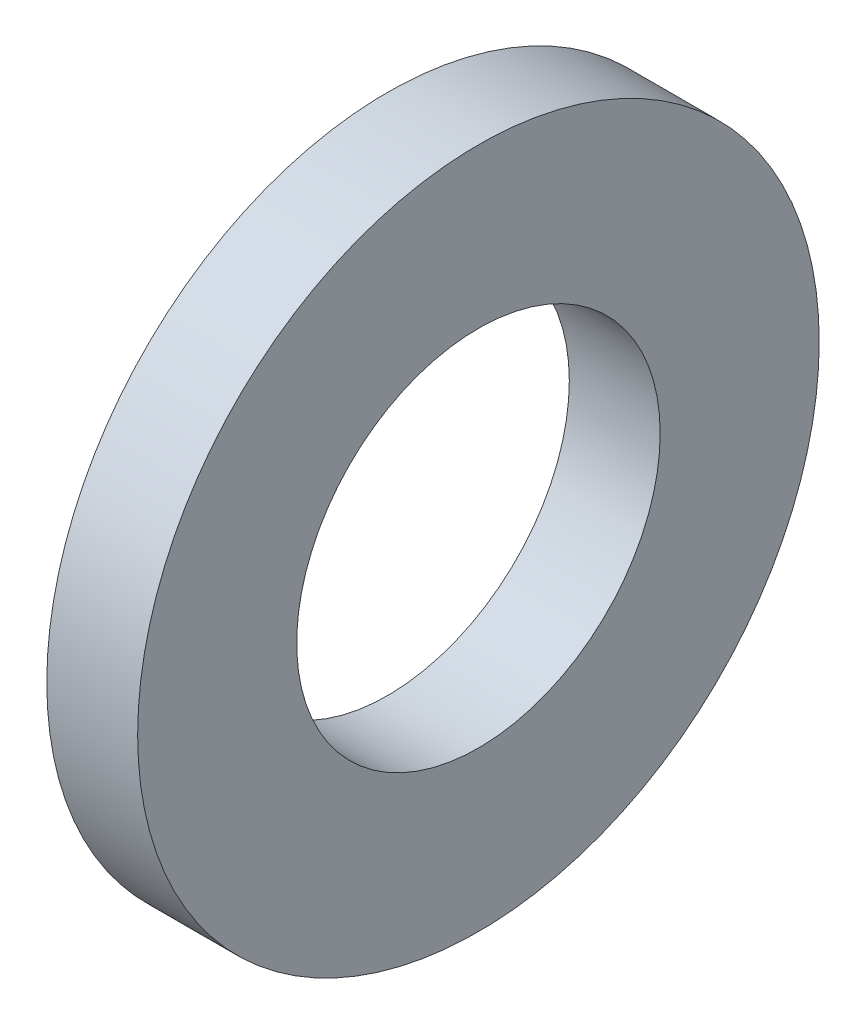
ISO-10303-21;
HEADER;
FILE_DESCRIPTION(('STEP AP214'),'2;1');
FILE_NAME('part.step','',(''),(''),'','','');
FILE_SCHEMA(('AUTOMOTIVE_DESIGN { 1 0 10303 214 1 1 1 1 }'));
ENDSEC;
DATA;
#1=APPLICATION_CONTEXT('core data for automotive mechanical design processes');
#2=APPLICATION_PROTOCOL_DEFINITION('international standard','automotive_design',2000,#1);
#3=PRODUCT_CONTEXT('',#1,'mechanical');
#4=PRODUCT('Part','Part','',(#3));
#5=PRODUCT_RELATED_PRODUCT_CATEGORY('part','',(#4));
#6=PRODUCT_DEFINITION_FORMATION('','',#4);
#7=PRODUCT_DEFINITION_CONTEXT('part definition',#1,'design');
#8=PRODUCT_DEFINITION('design','',#6,#7);
#9=PRODUCT_DEFINITION_SHAPE('','',#8);
#10=(LENGTH_UNIT() NAMED_UNIT(*) SI_UNIT(.MILLI.,.METRE.));
#11=(NAMED_UNIT(*) PLANE_ANGLE_UNIT() SI_UNIT($,.RADIAN.));
#12=(NAMED_UNIT(*) SI_UNIT($,.STERADIAN.) SOLID_ANGLE_UNIT());
#13=UNCERTAINTY_MEASURE_WITH_UNIT(LENGTH_MEASURE(1.E-05),#10,'distance_accuracy_value','');
#14=(GEOMETRIC_REPRESENTATION_CONTEXT(3) GLOBAL_UNCERTAINTY_ASSIGNED_CONTEXT((#13)) GLOBAL_UNIT_ASSIGNED_CONTEXT((#10,
#11,#12)) REPRESENTATION_CONTEXT('',''));
#15=CARTESIAN_POINT('',(0.,0.,0.));
#16=DIRECTION('',(0.,0.,1.));
#17=DIRECTION('',(1.,0.,0.));
#18=AXIS2_PLACEMENT_3D('',#15,#16,#17);
#19=CARTESIAN_POINT('',(3.8,0.,0.));
#20=DIRECTION('',(1.,0.,0.));
#21=DIRECTION('',(0.,0.,-1.));
#22=AXIS2_PLACEMENT_3D('',#19,#20,#21);
#23=CYLINDRICAL_SURFACE('',#22,3.);
#24=CARTESIAN_POINT('',(0.8,0.,0.));
#25=DIRECTION('',(1.,0.,0.));
#26=DIRECTION('',(0.,0.,-1.));
#27=AXIS2_PLACEMENT_3D('',#24,#25,#26);
#28=CIRCLE('',#27,3.);
#29=CARTESIAN_POINT('',(0.8,0.,-3.));
#30=VERTEX_POINT('',#29);
#31=EDGE_CURVE('E10',#30,#30,#28,.T.);
#32=ORIENTED_EDGE('',*,*,#31,.F.);
#33=EDGE_LOOP('',(#32));
#34=FACE_BOUND('',#33,.T.);
#35=CARTESIAN_POINT('',(0.,0.,0.));
#36=DIRECTION('',(1.,0.,0.));
#37=DIRECTION('',(0.,0.,-1.));
#38=AXIS2_PLACEMENT_3D('',#35,#36,#37);
#39=CIRCLE('',#38,3.);
#40=CARTESIAN_POINT('',(0.,0.,-3.));
#41=VERTEX_POINT('',#40);
#42=EDGE_CURVE('E41',#41,#41,#39,.T.);
#43=ORIENTED_EDGE('',*,*,#42,.T.);
#44=EDGE_LOOP('',(#43));
#45=FACE_BOUND('',#44,.T.);
#46=ADVANCED_FACE('F16',(#34,#45),#23,.T.);
#47=CARTESIAN_POINT('',(0.8,1.6,0.));
#48=DIRECTION('',(1.,0.,0.));
#49=DIRECTION('',(0.,0.,-1.));
#50=AXIS2_PLACEMENT_3D('',#47,#48,#49);
#51=PLANE('',#50);
#52=CARTESIAN_POINT('',(0.8,0.,0.));
#53=DIRECTION('',(1.,0.,0.));
#54=DIRECTION('',(0.,0.,-1.));
#55=AXIS2_PLACEMENT_3D('',#52,#53,#54);
#56=CIRCLE('',#55,1.6);
#57=CARTESIAN_POINT('',(0.8,0.,-1.6));
#58=VERTEX_POINT('',#57);
#59=EDGE_CURVE('E23',#58,#58,#56,.T.);
#60=ORIENTED_EDGE('',*,*,#59,.F.);
#61=EDGE_LOOP('',(#60));
#62=FACE_BOUND('',#61,.T.);
#63=ORIENTED_EDGE('',*,*,#31,.T.);
#64=EDGE_LOOP('',(#63));
#65=FACE_BOUND('',#64,.T.);
#66=ADVANCED_FACE('F54',(#62,#65),#51,.T.);
#67=CARTESIAN_POINT('',(3.8,0.,0.));
#68=DIRECTION('',(1.,0.,0.));
#69=DIRECTION('',(0.,0.,-1.));
#70=AXIS2_PLACEMENT_3D('',#67,#68,#69);
#71=CYLINDRICAL_SURFACE('',#70,1.6);
#72=CARTESIAN_POINT('',(0.,0.,0.));
#73=DIRECTION('',(1.,0.,0.));
#74=DIRECTION('',(0.,0.,-1.));
#75=AXIS2_PLACEMENT_3D('',#72,#73,#74);
#76=CIRCLE('',#75,1.6);
#77=CARTESIAN_POINT('',(0.,0.,-1.6));
#78=VERTEX_POINT('',#77);
#79=EDGE_CURVE('E38',#78,#78,#76,.T.);
#80=ORIENTED_EDGE('',*,*,#79,.F.);
#81=EDGE_LOOP('',(#80));
#82=FACE_BOUND('',#81,.T.);
#83=ORIENTED_EDGE('',*,*,#59,.T.);
#84=EDGE_LOOP('',(#83));
#85=FACE_BOUND('',#84,.T.);
#86=ADVANCED_FACE('F48',(#82,#85),#71,.F.);
#87=CARTESIAN_POINT('',(0.,3.,0.));
#88=DIRECTION('',(-1.,0.,0.));
#89=DIRECTION('',(0.,0.,1.));
#90=AXIS2_PLACEMENT_3D('',#87,#88,#89);
#91=PLANE('',#90);
#92=ORIENTED_EDGE('',*,*,#42,.F.);
#93=EDGE_LOOP('',(#92));
#94=FACE_BOUND('',#93,.T.);
#95=ORIENTED_EDGE('',*,*,#79,.T.);
#96=EDGE_LOOP('',(#95));
#97=FACE_BOUND('',#96,.T.);
#98=ADVANCED_FACE('F39',(#94,#97),#91,.T.);
#99=CLOSED_SHELL('',(#46,#66,#86,#98));
#100=MANIFOLD_SOLID_BREP('B1',#99);
#101=ADVANCED_BREP_SHAPE_REPRESENTATION('',(#18,#100),#14);
#102=SHAPE_DEFINITION_REPRESENTATION(#9,#101);
ENDSEC;
END-ISO-10303-21;
